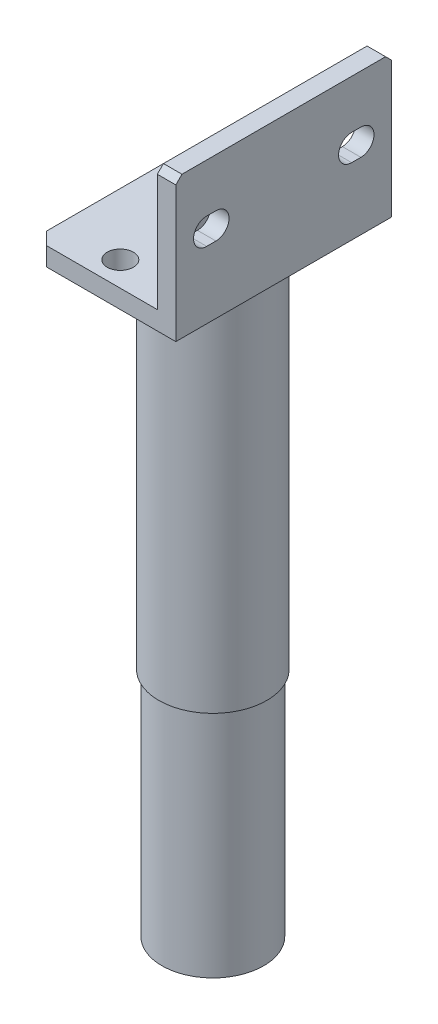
from build123d import *
from build123d.topology import SkipClean

# Parameters (mm, degrees)
EXTRUDE_1_DEPTH     = 70
SKETCH_5_R          = 4.25
CUT_EXTRUDE_2_DEPTH = 400
CHAMFER_1_SIZE      = 4
CUT_EXTRUDE_1_DEPTH = 93.822411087
CHAMFER_2_SIZE      = 2
SKETCH_4_R          = 17.5
SKETCH_4_R_2        = 10
EXTRUDE_2_DEPTH     = 196
SKETCH_6_R          = 10
CUT_EXTRUDE_3_DEPTH = 214.14783602
SKETCH_8_W          = 1
SKETCH_8_H          = 75


with BuildPart() as part:
    # Sketch 1 → Extrude 1 (new body)
    with BuildSketch(Plane.XY):
        Polygon((0, 0), (46, 0), (46, 46), (40, 46), (40, 6), (0, 6), align=None)
    extrude(amount=EXTRUDE_1_DEPTH)

    # Sketch 5 → Cut-Extrude 2 (cut)
    with BuildSketch(Plane(origin=(0, 6, 0), x_dir=(-1, 0, 0), z_dir=(0, 1, 0))):
        with Locations((-20, 8)):
            Circle(SKETCH_5_R)
    cut_extrude_2 = extrude(amount=-CUT_EXTRUDE_2_DEPTH, mode=Mode.SUBTRACT)

    # Chamfer 1
    chamfer_1_edges = [part.edges().sort_by_distance(p)[0] for p in [
        (0, 3, 70),
        (0, 3, 0),
    ]]
    chamfer(chamfer_1_edges, length=CHAMFER_1_SIZE)

    # Sketch 3 → Cut-Extrude 1 (cut, through all)
    with BuildSketch(Plane.ZY.offset(-40)):
        with BuildLine():
            Line((10, 30.25), (13, 30.25))
            ThreePointArc((13, 30.25), (17.25, 26), (13, 21.75))
            Line((13, 21.75), (10, 21.75))
            ThreePointArc((10, 21.75), (5.75, 26), (10, 30.25))
        make_face()
    cut_extrude_1 = extrude(amount=-CUT_EXTRUDE_1_DEPTH, mode=Mode.SUBTRACT)

    # Mirror 1: Cut-Extrude 1 across plane
    add(cut_extrude_1.mirror(Plane.XY.offset(35)), mode=Mode.SUBTRACT)

    # Mirror 2: Cut-Extrude 2 across plane
    add(cut_extrude_2.mirror(Plane.XY.offset(35)), mode=Mode.SUBTRACT)

    # Chamfer 2
    chamfer_2_edges = [part.edges().sort_by_distance(p)[0] for p in [
        (43, 46, 70),
        (43, 46, 0),
    ]]
    chamfer(chamfer_2_edges, length=CHAMFER_2_SIZE)

    # Sketch 4 → Extrude 2 (add)
    with BuildSketch(Plane.XZ):
        with Locations(Location((23, 35, 0), (0, 0, 90))):
            Circle(SKETCH_4_R)
        with Locations(Location((23, 35, 0), (0, 0, 270))):
            Circle(SKETCH_4_R_2, mode=Mode.SUBTRACT)
    extrude(amount=EXTRUDE_2_DEPTH)

    # Sketch 6 → Cut-Extrude 3 (cut, through all)
    with SkipClean():  # the faces are left unmerged after this step: merging them gives an invalid solid
        with BuildSketch(Plane.XZ):
            with Locations((23, 35)):
                Circle(SKETCH_6_R)
        extrude(amount=-CUT_EXTRUDE_3_DEPTH, mode=Mode.SUBTRACT)

    # Sketch 8 → Cut-Revolve 2 (revolve, cut)
    with SkipClean():  # the faces are left unmerged after this step: merging them gives an invalid solid
        with BuildSketch(Plane.XY.offset(35), mode=Mode.PRIVATE) as cut_revolve_2_sk:
            with Locations((40, -158.5)):
                Rectangle(SKETCH_8_W, SKETCH_8_H)
        revolve(cut_revolve_2_sk.sketch.rotate(Axis((23, -196, 35), (0, -1, 0)), 90), axis=Axis((23, -196, 35), (0, -1, 0)), mode=Mode.SUBTRACT)


solid = part.part
